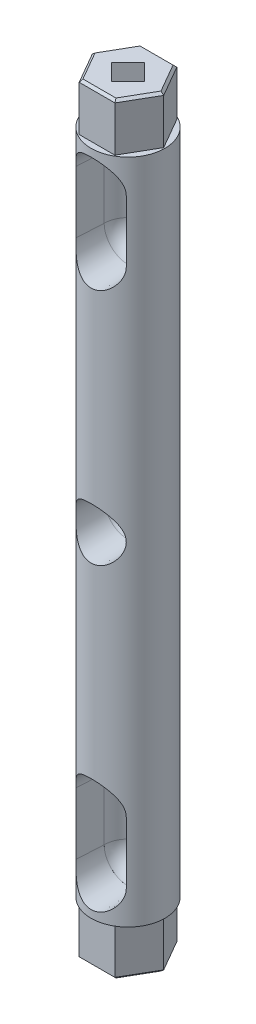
from build123d import *

# Parameters (mm, degrees)
SKETCH1_R                        = 7.75
BOSS_EXTRUDE1_DEPTH              = 140
SKETCH2_R                        = 5
CUT_EXTRUDE1_DEPTH               = 141.42836252
CUT_EXTRUDE1_TAPER               = -3
BOSS_EXTRUDE2_DEPTH              = 10
BOSS_EXTRUDE3_DEPTH              = 10
F_10_0_1935_DIAMETER_HOLE1_D     = 4.9149
F_10_0_1935_DIAMETER_HOLE1_DEPTH = 5
F_10_0_1935_DIAMETER_HOLE1_TIP   = 1.476584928
F_10_0_1935_DIAMETER_HOLE2_D     = 4.9149
F_10_0_1935_DIAMETER_HOLE2_DEPTH = 5
F_10_0_1935_DIAMETER_HOLE2_TIP   = 1.476584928
CUT_EXTRUDE2_DEPTH               = 10
CUT_EXTRUDE3_DEPTH               = 10
CHAMFER1_SIZE                    = 0.5
CHAMFER2_SIZE                    = 0.5


with BuildPart() as part:
    # Sketch1 → Boss-Extrude1 (new body)
    with BuildSketch(Plane(origin=(0, 0, 0), x_dir=(1, 0, 0), z_dir=(0, 1, 0))):
        with Locations(Location((0, 0, 0), (0, 0, 270))):
            Circle(SKETCH1_R)
    extrude(amount=BOSS_EXTRUDE1_DEPTH)

    # Sketch2 → Cut-Extrude1 (cut, through all)
    with BuildSketch(Plane.XY):
        with Locations((0, 70)):
            Circle(SKETCH2_R)
        with BuildLine():
            Line((-5, 133), (-5, 121))
            Line((-5, 121), (-5, 120))
            ThreePointArc((-5, 120), (0, 115), (5, 120))
            Line((5, 120), (5, 121))
            Line((5, 121), (5, 133))
            ThreePointArc((5, 133), (0, 138), (-5, 133))
        make_face()
        with BuildLine():
            Line((-5, 19), (-5, 7))
            ThreePointArc((-5, 7), (0, 2), (5, 7))
            Line((5, 7), (5, 19))
            Line((5, 19), (5, 20))
            ThreePointArc((5, 20), (0, 25), (-5, 20))
            Line((-5, 20), (-5, 19))
        make_face()
    extrude(amount=CUT_EXTRUDE1_DEPTH, taper=CUT_EXTRUDE1_TAPER, mode=Mode.SUBTRACT)

    # Sketch3 → Cut-Revolve1 (revolve, cut)
    with BuildSketch(Plane.XY):
        with BuildLine():
            Line((0.00462784, 11), (0.00462784, 2.010909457))
            ThreePointArc((0.00462784, 2.010909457), (3.53466918, 3.47179966), (5, 7))
            Line((5, 7), (5, 20))
            ThreePointArc((5, 20), (3.536889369, 23.532261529), (0.00462784, 24.99537216))
            Line((0.00462784, 24.99537216), (0.00462784, 11))
        make_face()
        with BuildLine():
            Line((0, 75), (0, 65))
            ThreePointArc((0, 65), (5, 70), (0, 75))
        make_face()
        with BuildLine():
            Line((0, 138), (0, 130))
            Line((0, 130), (0, 115))
            ThreePointArc((0, 115), (3.535533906, 116.464466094), (5, 120))
            Line((5, 120), (5, 133))
            ThreePointArc((5, 133), (3.535533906, 136.535533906), (0, 138))
        make_face()
    revolve(axis=Axis((0, 140, 0), (0, -1, 0)), mode=Mode.SUBTRACT)

    # Sketch4 → Boss-Extrude2 (add)
    with BuildSketch(Plane(origin=(0, 140, 0), x_dir=(1, 0, 0), z_dir=(0, 1, 0))):
        Polygon((7.5, 0), (3.75, 6.495190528), (-3.75, 6.495190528), (-7.5, 0), (-3.75, -6.495190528), (3.75, -6.495190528), align=None)
    extrude(amount=BOSS_EXTRUDE2_DEPTH)

    # Sketch5 → Boss-Extrude3 (add)
    with BuildSketch(Plane(origin=(0, 0, 0), x_dir=(-1, 0, 0), z_dir=(0, -1, 0))):
        Polygon((-7.5, 0), (-3.75, -6.495190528), (3.75, -6.495190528), (7.5, 0), (3.75, 6.495190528), (-3.75, 6.495190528), align=None)
    extrude(amount=BOSS_EXTRUDE3_DEPTH)

    # 10 _0.1935_ Diameter Hole1
    with Locations(Plane(origin=(0, 150, 0), x_dir=(1, 0, 0), z_dir=(0, 1, 0))):
        with Locations((0, 0)):
            Hole(F_10_0_1935_DIAMETER_HOLE1_D / 2, depth=F_10_0_1935_DIAMETER_HOLE1_DEPTH)
            with Locations((0, 0, -(F_10_0_1935_DIAMETER_HOLE1_DEPTH + F_10_0_1935_DIAMETER_HOLE1_TIP / 2))):  # 118° drill point
                Cone(0, F_10_0_1935_DIAMETER_HOLE1_D / 2, F_10_0_1935_DIAMETER_HOLE1_TIP, mode=Mode.SUBTRACT)

    # 10 _0.1935_ Diameter Hole2
    with Locations(Plane(origin=(0, -10, 0), x_dir=(-1, 0, 0), z_dir=(0, -1, 0))):
        with Locations((0, 0)):
            Hole(F_10_0_1935_DIAMETER_HOLE2_D / 2, depth=F_10_0_1935_DIAMETER_HOLE2_DEPTH)
            with Locations((0, 0, -(F_10_0_1935_DIAMETER_HOLE2_DEPTH + F_10_0_1935_DIAMETER_HOLE2_TIP / 2))):  # 118° drill point
                Cone(0, F_10_0_1935_DIAMETER_HOLE2_D / 2, F_10_0_1935_DIAMETER_HOLE2_TIP, mode=Mode.SUBTRACT)

    # Sketch11 → Cut-Extrude2 (cut)
    with BuildSketch(Plane(origin=(0, 150, 0), x_dir=(1, 0, 0), z_dir=(0, 1, 0))):
        Polygon((0, 3.487644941), (3.487644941, 0), (0, -3.487644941), (-3.487644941, 0), align=None)
    extrude(amount=-CUT_EXTRUDE2_DEPTH, mode=Mode.SUBTRACT)

    # Sketch12 → Cut-Extrude3 (cut)
    with BuildSketch(Plane(origin=(0, -10, 0), x_dir=(-1, 0, 0), z_dir=(0, -1, 0))):
        Polygon((0, -3.487644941), (-3.487644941, 0), (0, 3.487644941), (3.487644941, 0), align=None)
    extrude(amount=-CUT_EXTRUDE3_DEPTH, mode=Mode.SUBTRACT)

    # Chamfer1
    chamfer1_edges = [part.edges().sort_by_distance(p)[0] for p in [
        (5.625, 150, 3.247595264),
        (5.625, 150, -3.247595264),
        (0, 150, -6.495190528),
        (-5.625, 150, -3.247595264),
        (-5.625, 150, 3.247595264),
        (0, 150, 6.495190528),
    ]]
    chamfer(chamfer1_edges, length=CHAMFER1_SIZE)

    # Chamfer2
    chamfer2_edges = [part.edges().sort_by_distance(p)[0] for p in [
        (5.625, -10, -3.247595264),
        (5.625, -10, 3.247595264),
        (0, -10, 6.495190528),
        (-5.625, -10, 3.247595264),
        (-5.625, -10, -3.247595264),
        (0, -10, -6.495190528),
    ]]
    chamfer(chamfer2_edges, length=CHAMFER2_SIZE)


solid = part.part
